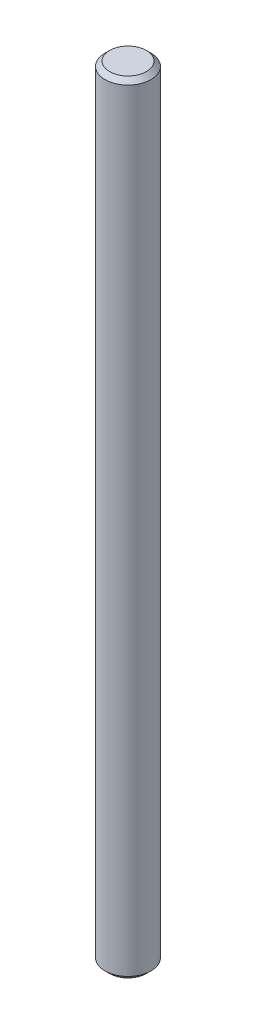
from build123d import *

# Parameters (mm, degrees)
SKETCH1_R      = 2
EXTRUDE1_DEPTH = 68
CHAMFER1_SIZE  = 0.4


with BuildPart() as part:
    # Sketch1 → Extrude1 (new body)
    with BuildSketch(Plane(origin=(0, 0, 0), x_dir=(1, 0, 0), z_dir=(0, 1, 0))):
        with Locations(Location((0, 0, 0), (0, 0, 270))):
            Circle(SKETCH1_R)
    extrude(amount=EXTRUDE1_DEPTH)

    # Chamfer1
    chamfer1_edges = [part.edges().sort_by_distance(p)[0] for p in [
        (0, 0, -2),
        (0, 68, -2),
    ]]
    chamfer(chamfer1_edges, length=CHAMFER1_SIZE)


solid = part.part
